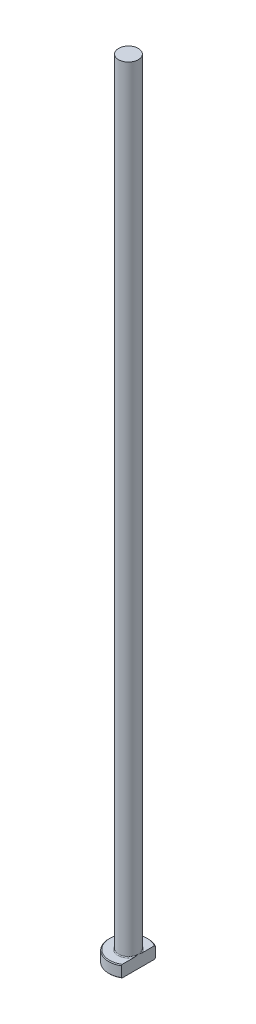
ISO-10303-21;
HEADER;
FILE_DESCRIPTION(('STEP AP214'),'2;1');
FILE_NAME('part.step','',(''),(''),'','','');
FILE_SCHEMA(('AUTOMOTIVE_DESIGN { 1 0 10303 214 1 1 1 1 }'));
ENDSEC;
DATA;
#1=APPLICATION_CONTEXT('core data for automotive mechanical design processes');
#2=APPLICATION_PROTOCOL_DEFINITION('international standard','automotive_design',2000,#1);
#3=PRODUCT_CONTEXT('',#1,'mechanical');
#4=PRODUCT('Part','Part','',(#3));
#5=PRODUCT_RELATED_PRODUCT_CATEGORY('part','',(#4));
#6=PRODUCT_DEFINITION_FORMATION('','',#4);
#7=PRODUCT_DEFINITION_CONTEXT('part definition',#1,'design');
#8=PRODUCT_DEFINITION('design','',#6,#7);
#9=PRODUCT_DEFINITION_SHAPE('','',#8);
#10=(LENGTH_UNIT() NAMED_UNIT(*) SI_UNIT(.MILLI.,.METRE.));
#11=(NAMED_UNIT(*) PLANE_ANGLE_UNIT() SI_UNIT($,.RADIAN.));
#12=(NAMED_UNIT(*) SI_UNIT($,.STERADIAN.) SOLID_ANGLE_UNIT());
#13=UNCERTAINTY_MEASURE_WITH_UNIT(LENGTH_MEASURE(1.E-05),#10,'distance_accuracy_value','');
#14=(GEOMETRIC_REPRESENTATION_CONTEXT(3) GLOBAL_UNCERTAINTY_ASSIGNED_CONTEXT((#13)) GLOBAL_UNIT_ASSIGNED_CONTEXT((#10,
#11,#12)) REPRESENTATION_CONTEXT('',''));
#15=CARTESIAN_POINT('',(0.,0.,0.));
#16=DIRECTION('',(0.,0.,1.));
#17=DIRECTION('',(1.,0.,0.));
#18=AXIS2_PLACEMENT_3D('',#15,#16,#17);
#19=CARTESIAN_POINT('',(0.,0.,0.));
#20=DIRECTION('',(0.,-1.,0.));
#21=DIRECTION('',(0.,0.,-1.));
#22=AXIS2_PLACEMENT_3D('',#19,#20,#21);
#23=PLANE('',#22);
#24=CARTESIAN_POINT('',(0.,0.,0.));
#25=DIRECTION('',(0.,-1.,0.));
#26=DIRECTION('',(0.,0.,-1.));
#27=AXIS2_PLACEMENT_3D('',#24,#25,#26);
#28=CIRCLE('',#27,4.79999999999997);
#29=CARTESIAN_POINT('',(2.49999999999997,0.,4.09756024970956));
#30=VERTEX_POINT('',#29);
#31=CARTESIAN_POINT('',(2.49999999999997,0.,-4.09756024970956));
#32=VERTEX_POINT('',#31);
#33=EDGE_CURVE('E98',#30,#32,#28,.T.);
#34=ORIENTED_EDGE('',*,*,#33,.T.);
#35=DIRECTION('',(0.,0.,1.));
#36=VECTOR('',#35,1.);
#37=CARTESIAN_POINT('',(2.49999999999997,0.,-4.33012701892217));
#38=LINE('',#37,#36);
#39=EDGE_CURVE('E83',#32,#30,#38,.T.);
#40=ORIENTED_EDGE('',*,*,#39,.T.);
#41=EDGE_LOOP('',(#34,#40));
#42=FACE_BOUND('',#41,.T.);
#43=ADVANCED_FACE('F32',(#42),#23,.T.);
#44=CARTESIAN_POINT('',(0.,259.958771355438,0.));
#45=DIRECTION('',(0.,1.,0.));
#46=DIRECTION('',(0.,0.,1.));
#47=AXIS2_PLACEMENT_3D('',#44,#45,#46);
#48=CYLINDRICAL_SURFACE('',#47,4.99999999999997);
#49=CARTESIAN_POINT('',(0.,2.79999999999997,0.));
#50=DIRECTION('',(0.,1.,0.));
#51=DIRECTION('',(0.,0.,1.));
#52=AXIS2_PLACEMENT_3D('',#49,#50,#51);
#53=CIRCLE('',#52,4.99999999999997);
#54=CARTESIAN_POINT('',(2.49999999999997,2.79999999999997,4.33012701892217));
#55=VERTEX_POINT('',#54);
#56=CARTESIAN_POINT('',(2.49999999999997,2.79999999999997,-4.33012701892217));
#57=VERTEX_POINT('',#56);
#58=EDGE_CURVE('E104',#55,#57,#53,.F.);
#59=ORIENTED_EDGE('',*,*,#58,.T.);
#60=DIRECTION('',(0.,-1.,0.));
#61=VECTOR('',#60,1.);
#62=CARTESIAN_POINT('',(2.49999999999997,200.,-4.33012701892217));
#63=LINE('',#62,#61);
#64=CARTESIAN_POINT('',(2.49999999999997,0.200000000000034,-4.33012701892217));
#65=VERTEX_POINT('',#64);
#66=EDGE_CURVE('E183',#57,#65,#63,.T.);
#67=ORIENTED_EDGE('',*,*,#66,.T.);
#68=CARTESIAN_POINT('',(0.,0.200000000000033,0.));
#69=DIRECTION('',(0.,-1.,0.));
#70=DIRECTION('',(0.,0.,-1.));
#71=AXIS2_PLACEMENT_3D('',#68,#69,#70);
#72=CIRCLE('',#71,4.99999999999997);
#73=CARTESIAN_POINT('',(2.49999999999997,0.200000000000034,4.33012701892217));
#74=VERTEX_POINT('',#73);
#75=EDGE_CURVE('E100',#65,#74,#72,.F.);
#76=ORIENTED_EDGE('',*,*,#75,.T.);
#77=DIRECTION('',(0.,-1.,0.));
#78=VECTOR('',#77,1.);
#79=CARTESIAN_POINT('',(2.49999999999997,200.,4.33012701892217));
#80=LINE('',#79,#78);
#81=EDGE_CURVE('E93',#55,#74,#80,.T.);
#82=ORIENTED_EDGE('',*,*,#81,.F.);
#83=EDGE_LOOP('',(#59,#67,#76,#82));
#84=FACE_BOUND('',#83,.T.);
#85=ADVANCED_FACE('F158',(#84),#48,.T.);
#86=CARTESIAN_POINT('',(-4.99999999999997,3.,0.));
#87=DIRECTION('',(0.,1.,0.));
#88=DIRECTION('',(0.,0.,1.));
#89=AXIS2_PLACEMENT_3D('',#86,#87,#88);
#90=PLANE('',#89);
#91=CARTESIAN_POINT('',(0.,3.,0.));
#92=DIRECTION('',(0.,1.,0.));
#93=DIRECTION('',(0.,0.,1.));
#94=AXIS2_PLACEMENT_3D('',#91,#92,#93);
#95=CIRCLE('',#94,4.79999999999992);
#96=CARTESIAN_POINT('',(2.49999999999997,3.,-4.0975602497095));
#97=VERTEX_POINT('',#96);
#98=CARTESIAN_POINT('',(2.49999999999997,3.,4.0975602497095));
#99=VERTEX_POINT('',#98);
#100=EDGE_CURVE('E178',#97,#99,#95,.T.);
#101=ORIENTED_EDGE('',*,*,#100,.T.);
#102=DIRECTION('',(0.,0.,-1.));
#103=VECTOR('',#102,1.);
#104=CARTESIAN_POINT('',(2.49999999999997,3.,0.));
#105=LINE('',#104,#103);
#106=CARTESIAN_POINT('',(2.49999999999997,2.99999999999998,1.01980390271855));
#107=VERTEX_POINT('',#106);
#108=EDGE_CURVE('E57',#99,#107,#105,.T.);
#109=ORIENTED_EDGE('',*,*,#108,.T.);
#110=CARTESIAN_POINT('',(0.,3.,0.));
#111=DIRECTION('',(0.,1.,0.));
#112=DIRECTION('',(0.,0.,1.));
#113=AXIS2_PLACEMENT_3D('',#110,#111,#112);
#114=CIRCLE('',#113,2.69999999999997);
#115=CARTESIAN_POINT('',(2.49999999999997,2.99999999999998,-1.01980390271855));
#116=VERTEX_POINT('',#115);
#117=EDGE_CURVE('E107',#107,#116,#114,.F.);
#118=ORIENTED_EDGE('',*,*,#117,.T.);
#119=EDGE_CURVE('E136',#116,#97,#105,.T.);
#120=ORIENTED_EDGE('',*,*,#119,.T.);
#121=EDGE_LOOP('',(#101,#109,#118,#120));
#122=FACE_BOUND('',#121,.T.);
#123=ADVANCED_FACE('F147',(#122),#90,.T.);
#124=CARTESIAN_POINT('',(0.,3.,0.));
#125=DIRECTION('',(0.,-1.,0.));
#126=DIRECTION('',(0.,0.,-1.));
#127=AXIS2_PLACEMENT_3D('',#124,#125,#126);
#128=CONICAL_SURFACE('',#127,4.79999999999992,0.785398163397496);
#129=ORIENTED_EDGE('',*,*,#58,.F.);
#130=CARTESIAN_POINT('',(2.49999999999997,-2.05039133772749,9.52786489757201));
#131=CARTESIAN_POINT('',(2.49999999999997,-1.8416036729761,9.31199733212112));
#132=CARTESIAN_POINT('',(2.49999999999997,-1.63304008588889,9.09591231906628));
#133=CARTESIAN_POINT('',(2.49999999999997,-1.21649358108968,8.66317810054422));
#134=CARTESIAN_POINT('',(2.49999999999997,-1.0085106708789,8.44652888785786));
#135=CARTESIAN_POINT('',(2.49999999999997,-0.593157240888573,8.01243155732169));
#136=CARTESIAN_POINT('',(2.49999999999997,-0.385787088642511,7.79498308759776));
#137=CARTESIAN_POINT('',(2.49999999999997,0.0280365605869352,7.3592177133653));
#138=CARTESIAN_POINT('',(2.49999999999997,0.234490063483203,7.14090081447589));
#139=CARTESIAN_POINT('',(2.49999999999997,0.642130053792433,6.70748960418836));
#140=CARTESIAN_POINT('',(2.49999999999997,0.8433398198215,6.49241720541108));
#141=CARTESIAN_POINT('',(2.49999999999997,1.2442538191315,6.06087422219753));
#142=CARTESIAN_POINT('',(2.49999999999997,1.44395806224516,5.84440364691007));
#143=CARTESIAN_POINT('',(2.49999999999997,1.84127751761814,5.40963663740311));
#144=CARTESIAN_POINT('',(2.49999999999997,2.03889317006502,5.19134060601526));
#145=CARTESIAN_POINT('',(2.49999999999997,2.43125043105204,4.75218509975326));
#146=CARTESIAN_POINT('',(2.49999999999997,2.62599215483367,4.53132572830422));
#147=CARTESIAN_POINT('',(2.49999999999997,2.93693788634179,4.17181619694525));
#148=CARTESIAN_POINT('',(2.49999999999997,3.05446493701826,4.03431188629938));
#149=CARTESIAN_POINT('',(2.49999999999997,3.28742704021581,3.7575148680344));
#150=CARTESIAN_POINT('',(2.49999999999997,3.40286188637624,3.618221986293));
#151=CARTESIAN_POINT('',(2.49999999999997,3.632132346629,3.3358649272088));
#152=CARTESIAN_POINT('',(2.49999999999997,3.74593818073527,3.1927764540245));
#153=CARTESIAN_POINT('',(2.49999999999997,3.96956266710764,2.90356071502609));
#154=CARTESIAN_POINT('',(2.49999999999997,4.0793822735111,2.75743418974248));
#155=CARTESIAN_POINT('',(2.49999999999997,4.29502410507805,2.45881038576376));
#156=CARTESIAN_POINT('',(2.49999999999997,4.40076032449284,2.30625006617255));
#157=CARTESIAN_POINT('',(2.49999999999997,4.55286945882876,2.07299325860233));
#158=CARTESIAN_POINT('',(2.49999999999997,4.60252613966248,1.9944419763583));
#159=CARTESIAN_POINT('',(2.49999999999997,4.69908164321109,1.83566827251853));
#160=CARTESIAN_POINT('',(2.49999999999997,4.74598077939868,1.75544604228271));
#161=CARTESIAN_POINT('',(2.49999999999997,4.83578466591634,1.59405362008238));
#162=CARTESIAN_POINT('',(2.49999999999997,4.87873126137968,1.5129070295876));
#163=CARTESIAN_POINT('',(2.49999999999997,4.96038600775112,1.34852090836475));
#164=CARTESIAN_POINT('',(2.49999999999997,4.99909338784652,1.26528100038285));
#165=CARTESIAN_POINT('',(2.49999999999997,5.10703093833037,1.01251774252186));
#166=CARTESIAN_POINT('',(2.49999999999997,5.16843307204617,0.839342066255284));
#167=CARTESIAN_POINT('',(2.49999999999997,5.23490554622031,0.579703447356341));
#168=CARTESIAN_POINT('',(2.49999999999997,5.25253806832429,0.496421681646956));
#169=CARTESIAN_POINT('',(2.49999999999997,5.27986337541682,0.328535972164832));
#170=CARTESIAN_POINT('',(2.49999999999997,5.2895568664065,0.243932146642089));
#171=CARTESIAN_POINT('',(2.49999999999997,5.30031768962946,0.0744340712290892));
#172=CARTESIAN_POINT('',(2.49999999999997,5.30141176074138,-0.0104584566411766));
#173=CARTESIAN_POINT('',(2.49999999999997,5.29496530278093,-0.179916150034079));
#174=CARTESIAN_POINT('',(2.49999999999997,5.28742406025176,-0.264481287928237));
#175=CARTESIAN_POINT('',(2.49999999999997,5.26433424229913,-0.431754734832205));
#176=CARTESIAN_POINT('',(2.49999999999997,5.24885436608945,-0.514472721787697));
#177=CARTESIAN_POINT('',(2.49999999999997,5.21085318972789,-0.678257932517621));
#178=CARTESIAN_POINT('',(2.49999999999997,5.18833104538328,-0.759324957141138));
#179=CARTESIAN_POINT('',(2.49999999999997,5.13718929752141,-0.920001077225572));
#180=CARTESIAN_POINT('',(2.49999999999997,5.1085353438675,-0.999599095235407));
#181=CARTESIAN_POINT('',(2.49999999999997,5.04628092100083,-1.15679278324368));
#182=CARTESIAN_POINT('',(2.49999999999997,5.01268146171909,-1.23438885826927));
#183=CARTESIAN_POINT('',(2.49999999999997,4.90558195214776,-1.46503672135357));
#184=CARTESIAN_POINT('',(2.49999999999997,4.82601567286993,-1.61526350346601));
#185=CARTESIAN_POINT('',(2.49999999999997,4.65635232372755,-1.90970759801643));
#186=CARTESIAN_POINT('',(2.49999999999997,4.56624199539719,-2.05391702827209));
#187=CARTESIAN_POINT('',(2.49999999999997,4.37862201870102,-2.33821627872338));
#188=CARTESIAN_POINT('',(2.49999999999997,4.28108460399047,-2.47828761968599));
#189=CARTESIAN_POINT('',(2.49999999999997,4.08116271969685,-2.75478641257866));
#190=CARTESIAN_POINT('',(2.49999999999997,3.97878070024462,-2.8912156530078));
#191=CARTESIAN_POINT('',(2.49999999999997,3.76913910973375,-3.16313520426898));
#192=CARTESIAN_POINT('',(2.49999999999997,3.66183307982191,-3.29858952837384));
#193=CARTESIAN_POINT('',(2.49999999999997,3.44456217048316,-3.56736427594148));
#194=CARTESIAN_POINT('',(2.49999999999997,3.33459700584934,-3.70068446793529));
#195=CARTESIAN_POINT('',(2.49999999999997,3.11293465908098,-3.96532340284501));
#196=CARTESIAN_POINT('',(2.49999999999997,3.00124232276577,-4.09664621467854));
#197=CARTESIAN_POINT('',(2.49999999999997,2.77631276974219,-4.35796341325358));
#198=CARTESIAN_POINT('',(2.49999999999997,2.66307552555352,-4.48795777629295));
#199=CARTESIAN_POINT('',(2.49999999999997,2.36028773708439,-4.83228553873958));
#200=CARTESIAN_POINT('',(2.49999999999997,2.16967435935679,-5.04568363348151));
#201=CARTESIAN_POINT('',(2.49999999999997,1.78611780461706,-5.47037913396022));
#202=CARTESIAN_POINT('',(2.49999999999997,1.59317456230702,-5.68167648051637));
#203=CARTESIAN_POINT('',(2.49999999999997,1.20540648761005,-6.10290357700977));
#204=CARTESIAN_POINT('',(2.49999999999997,1.0105800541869,-6.31283185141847));
#205=CARTESIAN_POINT('',(2.49999999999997,0.619649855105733,-6.73149551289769));
#206=CARTESIAN_POINT('',(2.49999999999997,0.423546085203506,-6.94023089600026));
#207=CARTESIAN_POINT('',(2.49999999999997,0.0384434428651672,-7.34820392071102));
#208=CARTESIAN_POINT('',(2.49999999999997,-0.150515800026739,-7.54747899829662));
#209=CARTESIAN_POINT('',(2.49999999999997,-0.529153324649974,-7.94534601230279));
#210=CARTESIAN_POINT('',(2.49999999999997,-0.718831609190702,-8.14393794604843));
#211=CARTESIAN_POINT('',(2.49999999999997,-1.09855461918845,-8.54034636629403));
#212=CARTESIAN_POINT('',(2.49999999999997,-1.28859869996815,-8.73816347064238));
#213=CARTESIAN_POINT('',(2.49999999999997,-1.66916268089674,-9.13333639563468));
#214=CARTESIAN_POINT('',(2.49999999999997,-1.85968257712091,-9.33069222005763));
#215=CARTESIAN_POINT('',(2.49999999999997,-2.05039133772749,-9.52786489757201));
#216=B_SPLINE_CURVE_WITH_KNOTS('',3,(#130,#131,#132,#133,#134,#135,#136,#137,#138,#139,#140,
#141,#142,#143,#144,#145,#146,#147,#148,#149,#150,#151,#152,#153,#154,#155,#156,#157,#158,#159,
#160,#161,#162,#163,#164,#165,#166,#167,#168,#169,#170,#171,#172,#173,#174,#175,#176,#177,#178,
#179,#180,#181,#182,#183,#184,#185,#186,#187,#188,#189,#190,#191,#192,#193,#194,#195,#196,#197,
#198,#199,#200,#201,#202,#203,#204,#205,#206,#207,#208,#209,#210,#211,#212,#213,#214,#215),
.UNSPECIFIED.,.F.,.F.,(4,2,2,2,2,2,2,2,2,2,2,2,2,2,2,2,2,2,2,2,2,2,2,2,2,2,2,2,2,2,2,2,2,2,2,2,
2,2,2,2,2,2,4),(0.,0.900955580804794,1.8019227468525,2.70335062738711,3.60477268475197,
4.48832484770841,5.37187123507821,6.25522753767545,7.13854832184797,7.68119321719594,
8.22389134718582,8.77232299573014,9.3206224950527,9.87724663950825,10.1559936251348,
10.4347088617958,10.7100145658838,10.9853702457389,11.5339745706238,11.7890461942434,
12.0440951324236,12.2983507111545,12.5526272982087,12.8047396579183,13.0568822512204,
13.310476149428,13.5640183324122,14.0732618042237,14.5831526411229,15.0950533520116,
15.6066978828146,16.1250759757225,16.643509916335,17.1606868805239,17.6778730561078,
18.5362451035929,19.3946412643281,20.2538459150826,21.113053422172,21.9369112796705,
22.7607723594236,23.583714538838,24.4066499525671),.UNSPECIFIED.);
#217=EDGE_CURVE('E135',#55,#99,#216,.T.);
#218=ORIENTED_EDGE('',*,*,#217,.T.);
#219=ORIENTED_EDGE('',*,*,#100,.F.);
#220=EDGE_CURVE('E127',#97,#57,#216,.T.);
#221=ORIENTED_EDGE('',*,*,#220,.T.);
#222=EDGE_LOOP('',(#129,#218,#219,#221));
#223=FACE_BOUND('',#222,.T.);
#224=ADVANCED_FACE('F143',(#223),#128,.T.);
#225=CARTESIAN_POINT('',(0.,0.200000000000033,0.));
#226=DIRECTION('',(0.,1.,0.));
#227=DIRECTION('',(0.,0.,1.));
#228=AXIS2_PLACEMENT_3D('',#225,#226,#227);
#229=CONICAL_SURFACE('',#228,4.99999999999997,0.785398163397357);
#230=ORIENTED_EDGE('',*,*,#75,.F.);
#231=CARTESIAN_POINT('',(2.49999999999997,5.05039133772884,-9.52786489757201));
#232=CARTESIAN_POINT('',(2.49999999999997,4.84160367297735,-9.31199733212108));
#233=CARTESIAN_POINT('',(2.49999999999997,4.63304008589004,-9.0959123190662));
#234=CARTESIAN_POINT('',(2.49999999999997,4.21649358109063,-8.66317810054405));
#235=CARTESIAN_POINT('',(2.49999999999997,4.00851067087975,-8.44652888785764));
#236=CARTESIAN_POINT('',(2.49999999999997,3.59315724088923,-8.01243155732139));
#237=CARTESIAN_POINT('',(2.49999999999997,3.38578708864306,-7.79498308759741));
#238=CARTESIAN_POINT('',(2.49999999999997,2.97196343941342,-7.35921771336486));
#239=CARTESIAN_POINT('',(2.49999999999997,2.76550993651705,-7.1409008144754));
#240=CARTESIAN_POINT('',(2.49999999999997,2.35786994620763,-6.70748960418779));
#241=CARTESIAN_POINT('',(2.49999999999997,2.15666018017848,-6.49241720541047));
#242=CARTESIAN_POINT('',(2.49999999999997,1.7557461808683,-6.06087422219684));
#243=CARTESIAN_POINT('',(2.49999999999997,1.55604193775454,-5.84440364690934));
#244=CARTESIAN_POINT('',(2.49999999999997,1.15872248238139,-5.4096366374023));
#245=CARTESIAN_POINT('',(2.49999999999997,0.961106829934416,-5.1913406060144));
#246=CARTESIAN_POINT('',(2.49999999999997,0.568749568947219,-4.7521850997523));
#247=CARTESIAN_POINT('',(2.49999999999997,0.374007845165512,-4.53132572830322));
#248=CARTESIAN_POINT('',(2.49999999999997,0.0630621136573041,-4.17181619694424));
#249=CARTESIAN_POINT('',(2.49999999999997,-0.0544649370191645,-4.0343118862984));
#250=CARTESIAN_POINT('',(2.49999999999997,-0.287427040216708,-3.75751486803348));
#251=CARTESIAN_POINT('',(2.49999999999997,-0.40286188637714,-3.61822198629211));
#252=CARTESIAN_POINT('',(2.49999999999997,-0.632132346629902,-3.33586492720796));
#253=CARTESIAN_POINT('',(2.49999999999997,-0.745938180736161,-3.19277645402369));
#254=CARTESIAN_POINT('',(2.49999999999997,-0.969562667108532,-2.90356071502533));
#255=CARTESIAN_POINT('',(2.49999999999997,-1.07938227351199,-2.75743418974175));
#256=CARTESIAN_POINT('',(2.49999999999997,-1.29502410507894,-2.45881038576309));
#257=CARTESIAN_POINT('',(2.49999999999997,-1.40076032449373,-2.3062500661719));
#258=CARTESIAN_POINT('',(2.49999999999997,-1.55286945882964,-2.07299325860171));
#259=CARTESIAN_POINT('',(2.49999999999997,-1.60252613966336,-1.99444197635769));
#260=CARTESIAN_POINT('',(2.49999999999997,-1.69908164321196,-1.83566827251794));
#261=CARTESIAN_POINT('',(2.49999999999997,-1.74598077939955,-1.75544604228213));
#262=CARTESIAN_POINT('',(2.49999999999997,-1.8357846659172,-1.59405362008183));
#263=CARTESIAN_POINT('',(2.49999999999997,-1.87873126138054,-1.51290702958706));
#264=CARTESIAN_POINT('',(2.49999999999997,-1.96038600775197,-1.34852090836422));
#265=CARTESIAN_POINT('',(2.49999999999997,-1.99909338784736,-1.26528100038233));
#266=CARTESIAN_POINT('',(2.49999999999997,-2.10703093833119,-1.01251774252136));
#267=CARTESIAN_POINT('',(2.49999999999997,-2.16843307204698,-0.839342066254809));
#268=CARTESIAN_POINT('',(2.49999999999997,-2.23490554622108,-0.579703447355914));
#269=CARTESIAN_POINT('',(2.49999999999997,-2.25253806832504,-0.496421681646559));
#270=CARTESIAN_POINT('',(2.49999999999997,-2.27986337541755,-0.328535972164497));
#271=CARTESIAN_POINT('',(2.49999999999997,-2.28955686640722,-0.243932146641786));
#272=CARTESIAN_POINT('',(2.49999999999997,-2.30031768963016,-0.0744340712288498));
#273=CARTESIAN_POINT('',(2.49999999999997,-2.30141176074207,0.0104584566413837));
#274=CARTESIAN_POINT('',(2.49999999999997,-2.29496530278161,0.179916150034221));
#275=CARTESIAN_POINT('',(2.49999999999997,-2.28742406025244,0.264481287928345));
#276=CARTESIAN_POINT('',(2.49999999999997,-2.2643342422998,0.431754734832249));
#277=CARTESIAN_POINT('',(2.49999999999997,-2.24885436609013,0.514472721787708));
#278=CARTESIAN_POINT('',(2.49999999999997,-2.21085318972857,0.678257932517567));
#279=CARTESIAN_POINT('',(2.49999999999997,-2.18833104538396,0.759324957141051));
#280=CARTESIAN_POINT('',(2.49999999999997,-2.13718929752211,0.920001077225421));
#281=CARTESIAN_POINT('',(2.49999999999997,-2.10853534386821,0.999599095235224));
#282=CARTESIAN_POINT('',(2.49999999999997,-2.04628092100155,1.15679278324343));
#283=CARTESIAN_POINT('',(2.49999999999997,-2.01268146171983,1.23438885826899));
#284=CARTESIAN_POINT('',(2.49999999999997,-1.90558195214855,1.46503672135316));
#285=CARTESIAN_POINT('',(2.49999999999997,-1.82601567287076,1.61526350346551));
#286=CARTESIAN_POINT('',(2.49999999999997,-1.65635232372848,1.90970759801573));
#287=CARTESIAN_POINT('',(2.49999999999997,-1.56624199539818,2.05391702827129));
#288=CARTESIAN_POINT('',(2.49999999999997,-1.37862201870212,2.33821627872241));
#289=CARTESIAN_POINT('',(2.49999999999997,-1.28108460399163,2.47828761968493));
#290=CARTESIAN_POINT('',(2.49999999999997,-1.08116271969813,2.75478641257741));
#291=CARTESIAN_POINT('',(2.49999999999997,-0.978780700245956,2.89121565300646));
#292=CARTESIAN_POINT('',(2.49999999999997,-0.769139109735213,3.16313520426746));
#293=CARTESIAN_POINT('',(2.49999999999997,-0.661833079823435,3.29858952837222));
#294=CARTESIAN_POINT('',(2.49999999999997,-0.444562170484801,3.56736427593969));
#295=CARTESIAN_POINT('',(2.49999999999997,-0.334597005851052,3.70068446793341));
#296=CARTESIAN_POINT('',(2.49999999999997,-0.112934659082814,3.96532340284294));
#297=CARTESIAN_POINT('',(2.49999999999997,-0.00124232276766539,4.09664621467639));
#298=CARTESIAN_POINT('',(2.49999999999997,0.223687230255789,4.35796341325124));
#299=CARTESIAN_POINT('',(2.49999999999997,0.336924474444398,4.48795777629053));
#300=CARTESIAN_POINT('',(2.49999999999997,0.639712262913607,4.83228553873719));
#301=CARTESIAN_POINT('',(2.49999999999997,0.830325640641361,5.04568363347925));
#302=CARTESIAN_POINT('',(2.49999999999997,1.21388219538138,5.4703791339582));
#303=CARTESIAN_POINT('',(2.49999999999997,1.40682543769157,5.68167648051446));
#304=CARTESIAN_POINT('',(2.49999999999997,1.79459351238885,6.1029035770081));
#305=CARTESIAN_POINT('',(2.49999999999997,1.98941994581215,6.31283185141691));
#306=CARTESIAN_POINT('',(2.49999999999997,2.38035014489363,6.73149551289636));
#307=CARTESIAN_POINT('',(2.49999999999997,2.57645391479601,6.94023089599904));
#308=CARTESIAN_POINT('',(2.49999999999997,2.96155655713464,7.34820392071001));
#309=CARTESIAN_POINT('',(2.49999999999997,3.15051580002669,7.5474789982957));
#310=CARTESIAN_POINT('',(2.49999999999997,3.5291533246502,7.94534601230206));
#311=CARTESIAN_POINT('',(2.49999999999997,3.71883160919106,8.14393794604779));
#312=CARTESIAN_POINT('',(2.49999999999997,4.0985546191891,8.54034636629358));
#313=CARTESIAN_POINT('',(2.49999999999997,4.28859869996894,8.73816347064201));
#314=CARTESIAN_POINT('',(2.49999999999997,4.6691626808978,9.13333639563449));
#315=CARTESIAN_POINT('',(2.49999999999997,4.85968257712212,9.33069222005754));
#316=CARTESIAN_POINT('',(2.49999999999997,5.05039133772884,9.52786489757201));
#317=B_SPLINE_CURVE_WITH_KNOTS('',3,(#231,#232,#233,#234,#235,#236,#237,#238,#239,#240,#241,
#242,#243,#244,#245,#246,#247,#248,#249,#250,#251,#252,#253,#254,#255,#256,#257,#258,#259,#260,
#261,#262,#263,#264,#265,#266,#267,#268,#269,#270,#271,#272,#273,#274,#275,#276,#277,#278,#279,
#280,#281,#282,#283,#284,#285,#286,#287,#288,#289,#290,#291,#292,#293,#294,#295,#296,#297,#298,
#299,#300,#301,#302,#303,#304,#305,#306,#307,#308,#309,#310,#311,#312,#313,#314,#315,#316),
.UNSPECIFIED.,.F.,.F.,(4,2,2,2,2,2,2,2,2,2,2,2,2,2,2,2,2,2,2,2,2,2,2,2,2,2,2,2,2,2,2,2,2,2,2,2,
2,2,2,2,2,2,4),(0.,0.900955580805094,1.8019227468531,2.70335062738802,3.60477268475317,
4.48832484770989,5.37187123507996,6.25522753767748,7.13854832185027,7.68119321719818,
8.22389134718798,8.77232299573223,9.32062249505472,9.87724663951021,10.1559936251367,
10.4347088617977,10.7100145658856,10.9853702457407,11.5339745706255,11.789046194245,
12.0440951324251,12.298350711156,12.5526272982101,12.8047396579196,13.0568822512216,
13.3104761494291,13.5640183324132,14.0732618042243,14.5831526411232,15.0950533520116,
15.6066978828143,16.1250759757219,16.6435099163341,17.1606868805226,17.6778730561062,
18.5362451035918,19.3946412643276,20.2538459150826,21.1130534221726,21.9369112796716,
22.7607723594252,23.5837145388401,24.4066499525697),.UNSPECIFIED.);
#318=EDGE_CURVE('E86',#65,#32,#317,.T.);
#319=ORIENTED_EDGE('',*,*,#318,.T.);
#320=ORIENTED_EDGE('',*,*,#33,.F.);
#321=EDGE_CURVE('E89',#30,#74,#317,.T.);
#322=ORIENTED_EDGE('',*,*,#321,.T.);
#323=EDGE_LOOP('',(#230,#319,#320,#322));
#324=FACE_BOUND('',#323,.T.);
#325=ADVANCED_FACE('F97',(#324),#229,.T.);
#326=CARTESIAN_POINT('',(0.,3.19999999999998,0.));
#327=DIRECTION('',(0.,1.,0.));
#328=DIRECTION('',(0.,0.,1.));
#329=AXIS2_PLACEMENT_3D('',#326,#327,#328);
#330=TOROIDAL_SURFACE('',#329,2.69999999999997,0.2);
#331=CARTESIAN_POINT('',(2.49999999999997,3.19999999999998,0.));
#332=CARTESIAN_POINT('',(2.49999999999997,3.20000050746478,5.29061312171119E-11));
#333=CARTESIAN_POINT('',(2.49999999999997,3.20000101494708,-1.70517157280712E-07));
#334=CARTESIAN_POINT('',(2.49999999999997,3.20000196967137,-6.59443804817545E-07));
#335=CARTESIAN_POINT('',(2.49999999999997,3.20000240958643,-9.87883924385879E-07));
#336=CARTESIAN_POINT('',(2.49999999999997,3.20000331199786,-1.7724689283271E-06));
#337=CARTESIAN_POINT('',(2.49999999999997,3.20000376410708,-2.24097229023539E-06));
#338=CARTESIAN_POINT('',(2.49999999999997,3.20000458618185,-3.2218605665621E-06));
#339=CARTESIAN_POINT('',(2.49999999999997,3.20000495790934,-3.73286586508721E-06));
#340=CARTESIAN_POINT('',(2.49999999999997,3.20000630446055,-5.67453781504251E-06));
#341=CARTESIAN_POINT('',(2.49999999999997,3.20000720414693,-7.15943624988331E-06));
#342=CARTESIAN_POINT('',(2.49999999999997,3.20000871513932,-1.01304383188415E-05));
#343=CARTESIAN_POINT('',(2.49999999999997,3.20000934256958,-1.16087237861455E-05));
#344=CARTESIAN_POINT('',(2.49999999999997,3.20001191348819,-1.77555555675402E-05));
#345=CARTESIAN_POINT('',(2.49999999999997,3.20001378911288,-2.24564506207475E-05));
#346=CARTESIAN_POINT('',(2.49999999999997,3.20001661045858,-3.14167101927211E-05));
#347=CARTESIAN_POINT('',(2.49999999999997,3.20001764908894,-3.56468503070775E-05));
#348=CARTESIAN_POINT('',(2.49999999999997,3.20002511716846,-6.67543462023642E-05));
#349=CARTESIAN_POINT('',(2.49999999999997,3.20003067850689,-9.37930225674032E-05));
#350=CARTESIAN_POINT('',(2.49999999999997,3.20005501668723,-0.000200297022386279));
#351=CARTESIAN_POINT('',(2.49999999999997,3.20007833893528,-0.000278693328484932));
#352=CARTESIAN_POINT('',(2.49999999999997,3.20016883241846,-0.000588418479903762));
#353=CARTESIAN_POINT('',(2.49999999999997,3.2002329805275,-0.000820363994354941));
#354=CARTESIAN_POINT('',(2.49999999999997,3.20048923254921,-0.00173961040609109));
#355=CARTESIAN_POINT('',(2.49999999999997,3.20068508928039,-0.00242612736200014));
#356=CARTESIAN_POINT('',(2.49999999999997,3.201497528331,-0.00528196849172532));
#357=CARTESIAN_POINT('',(2.49999999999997,3.20210941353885,-0.0074522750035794));
#358=CARTESIAN_POINT('',(2.49999999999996,3.20774599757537,-0.0274346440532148));
#359=CARTESIAN_POINT('',(2.49999999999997,3.21279017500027,-0.0452427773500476));
#360=CARTESIAN_POINT('',(2.49999999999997,3.22264347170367,-0.080167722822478));
#361=CARTESIAN_POINT('',(2.49999999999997,3.22745402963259,-0.0972841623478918));
#362=CARTESIAN_POINT('',(2.49999999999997,3.23763483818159,-0.133672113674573));
#363=CARTESIAN_POINT('',(2.49999999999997,3.24299975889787,-0.15294514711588));
#364=CARTESIAN_POINT('',(2.49999999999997,3.25370389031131,-0.191722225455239));
#365=CARTESIAN_POINT('',(2.49999999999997,3.25904219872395,-0.211226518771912));
#366=CARTESIAN_POINT('',(2.49999999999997,3.27184445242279,-0.258540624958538));
#367=CARTESIAN_POINT('',(2.49999999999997,3.27925018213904,-0.286366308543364));
#368=CARTESIAN_POINT('',(2.49999999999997,3.29355148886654,-0.341371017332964));
#369=CARTESIAN_POINT('',(2.49999999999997,3.30045534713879,-0.368547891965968));
#370=CARTESIAN_POINT('',(2.49999999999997,3.31991129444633,-0.447507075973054));
#371=CARTESIAN_POINT('',(2.49999999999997,3.33195369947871,-0.499417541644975));
#372=CARTESIAN_POINT('',(2.49999999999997,3.35404241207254,-0.60418810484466));
#373=CARTESIAN_POINT('',(2.49999999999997,3.36406867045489,-0.657052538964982));
#374=CARTESIAN_POINT('',(2.49999999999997,3.38176575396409,-0.767598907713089));
#375=CARTESIAN_POINT('',(2.49999999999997,3.38917909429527,-0.825323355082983));
#376=CARTESIAN_POINT('',(2.49999999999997,3.39884096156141,-0.94105511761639));
#377=CARTESIAN_POINT('',(2.49999999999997,3.40111055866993,-0.999060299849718));
#378=CARTESIAN_POINT('',(2.49999999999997,3.39847691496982,-1.09324578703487));
#379=CARTESIAN_POINT('',(2.49999999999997,3.39593644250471,-1.12948454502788));
#380=CARTESIAN_POINT('',(2.49999999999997,3.38674319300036,-1.20096926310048));
#381=CARTESIAN_POINT('',(2.49999999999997,3.38015410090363,-1.2362219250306));
#382=CARTESIAN_POINT('',(2.49999999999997,3.36639936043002,-1.28579148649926));
#383=CARTESIAN_POINT('',(2.49999999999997,3.36162670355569,-1.30076836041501));
#384=CARTESIAN_POINT('',(2.49999999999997,3.35062798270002,-1.33028325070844));
#385=CARTESIAN_POINT('',(2.49999999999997,3.34439458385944,-1.34481861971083));
#386=CARTESIAN_POINT('',(2.49999999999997,3.33003808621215,-1.37319413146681));
#387=CARTESIAN_POINT('',(2.49999999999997,3.32189015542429,-1.38702194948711));
#388=CARTESIAN_POINT('',(2.49999999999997,3.30325367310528,-1.4129811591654));
#389=CARTESIAN_POINT('',(2.49999999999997,3.2927824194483,-1.42512406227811));
#390=CARTESIAN_POINT('',(2.49999999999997,3.27569207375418,-1.44029611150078));
#391=CARTESIAN_POINT('',(2.49999999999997,3.27021837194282,-1.4446101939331));
#392=CARTESIAN_POINT('',(2.49999999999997,3.25870897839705,-1.45242709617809));
#393=CARTESIAN_POINT('',(2.49999999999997,3.25267333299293,-1.45592998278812));
#394=CARTESIAN_POINT('',(2.49999999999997,3.24001938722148,-1.46191450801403));
#395=CARTESIAN_POINT('',(2.49999999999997,3.233395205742,-1.46438399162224));
#396=CARTESIAN_POINT('',(2.49999999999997,3.21979347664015,-1.46798853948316));
#397=CARTESIAN_POINT('',(2.49999999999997,3.21281651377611,-1.46912574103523));
#398=CARTESIAN_POINT('',(2.49999999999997,3.19961348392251,-1.46988240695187));
#399=CARTESIAN_POINT('',(2.49999999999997,3.19339654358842,-1.46966594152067));
#400=CARTESIAN_POINT('',(2.49999999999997,3.18110362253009,-1.46811597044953));
#401=CARTESIAN_POINT('',(2.49999999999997,3.17502769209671,-1.46678207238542));
#402=CARTESIAN_POINT('',(2.49999999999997,3.16354702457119,-1.46323301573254));
#403=CARTESIAN_POINT('',(2.49999999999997,3.15812390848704,-1.46107586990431));
#404=CARTESIAN_POINT('',(2.49999999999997,3.14763458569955,-1.45603007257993));
#405=CARTESIAN_POINT('',(2.49999999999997,3.14256845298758,-1.45314127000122));
#406=CARTESIAN_POINT('',(2.49999999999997,3.12963191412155,-1.44468844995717));
#407=CARTESIAN_POINT('',(2.49999999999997,3.12209714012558,-1.43861122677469));
#408=CARTESIAN_POINT('',(2.49999999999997,3.10805350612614,-1.42536327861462));
#409=CARTESIAN_POINT('',(2.49999999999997,3.10154826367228,-1.418188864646));
#410=CARTESIAN_POINT('',(2.49999999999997,3.08513615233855,-1.39772885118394));
#411=CARTESIAN_POINT('',(2.49999999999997,3.07611692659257,-1.38373739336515));
#412=CARTESIAN_POINT('',(2.49999999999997,3.06018433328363,-1.35465370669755));
#413=CARTESIAN_POINT('',(2.49999999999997,3.0532724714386,-1.33956070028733));
#414=CARTESIAN_POINT('',(2.49999999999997,3.04107204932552,-1.30868385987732));
#415=CARTESIAN_POINT('',(2.49999999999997,3.03578911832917,-1.29289784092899));
#416=CARTESIAN_POINT('',(2.49999999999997,3.02655583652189,-1.26093375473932));
#417=CARTESIAN_POINT('',(2.49999999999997,3.0226069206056,-1.24475528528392));
#418=CARTESIAN_POINT('',(2.49999999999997,3.01232854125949,-1.19551094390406));
#419=CARTESIAN_POINT('',(2.49999999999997,3.00769429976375,-1.16209442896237));
#420=CARTESIAN_POINT('',(2.49999999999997,3.00005311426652,-1.07761506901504));
#421=CARTESIAN_POINT('',(2.49999999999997,2.99913690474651,-1.02638928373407));
#422=CARTESIAN_POINT('',(2.49999999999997,3.00223345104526,-0.923947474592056));
#423=CARTESIAN_POINT('',(2.49999999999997,3.00626667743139,-0.872732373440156));
#424=CARTESIAN_POINT('',(2.49999999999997,3.01749958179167,-0.773934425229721));
#425=CARTESIAN_POINT('',(2.49999999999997,3.02448410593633,-0.72632575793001));
#426=CARTESIAN_POINT('',(2.49999999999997,3.04066526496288,-0.631906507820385));
#427=CARTESIAN_POINT('',(2.49999999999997,3.0498429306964,-0.585092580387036));
#428=CARTESIAN_POINT('',(2.49999999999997,3.06791405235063,-0.500780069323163));
#429=CARTESIAN_POINT('',(2.49999999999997,3.07652349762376,-0.463219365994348));
#430=CARTESIAN_POINT('',(2.49999999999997,3.09478102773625,-0.387318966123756));
#431=CARTESIAN_POINT('',(2.49999999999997,3.10445029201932,-0.348984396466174));
#432=CARTESIAN_POINT('',(2.49999999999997,3.12135487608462,-0.284095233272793));
#433=CARTESIAN_POINT('',(2.49999999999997,3.12843710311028,-0.257500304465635));
#434=CARTESIAN_POINT('',(2.49999999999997,3.14273562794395,-0.204655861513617));
#435=CARTESIAN_POINT('',(2.49999999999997,3.1499496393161,-0.178405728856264));
#436=CARTESIAN_POINT('',(2.49999999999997,3.1636921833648,-0.128877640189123));
#437=CARTESIAN_POINT('',(2.49999999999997,3.17020707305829,-0.10559584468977));
#438=CARTESIAN_POINT('',(2.49999999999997,3.18358099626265,-0.0580847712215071));
#439=CARTESIAN_POINT('',(2.49999999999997,3.19044308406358,-0.033856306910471));
#440=CARTESIAN_POINT('',(2.49999999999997,3.19789108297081,-0.00745034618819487));
#441=CARTESIAN_POINT('',(2.49999999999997,3.198503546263,-0.00527812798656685));
#442=CARTESIAN_POINT('',(2.49999999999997,3.1993161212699,-0.0024218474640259));
#443=CARTESIAN_POINT('',(2.49999999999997,3.19951155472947,-0.00173680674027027));
#444=CARTESIAN_POINT('',(2.49999999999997,3.19976729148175,-0.000819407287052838));
#445=CARTESIAN_POINT('',(2.49999999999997,3.19983133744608,-0.00058783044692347));
#446=CARTESIAN_POINT('',(2.49999999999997,3.19992170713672,-0.000278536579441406));
#447=CARTESIAN_POINT('',(2.49999999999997,3.19994501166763,-0.000200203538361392));
#448=CARTESIAN_POINT('',(2.49999999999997,3.19996933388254,-9.3772760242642E-05));
#449=CARTESIAN_POINT('',(2.49999999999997,3.19997489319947,-6.67431741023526E-05));
#450=CARTESIAN_POINT('',(2.49999999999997,3.1999823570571,-3.56449049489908E-05));
#451=CARTESIAN_POINT('',(2.49999999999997,3.19998339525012,-3.14152905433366E-05));
#452=CARTESIAN_POINT('',(2.49999999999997,3.19998621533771,-2.24560901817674E-05));
#453=CARTESIAN_POINT('',(2.49999999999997,3.19998809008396,-1.77557009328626E-05));
#454=CARTESIAN_POINT('',(2.49999999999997,3.19999065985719,-1.16093871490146E-05));
#455=CARTESIAN_POINT('',(2.49999999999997,3.1999912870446,-1.01311410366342E-05));
#456=CARTESIAN_POINT('',(2.49999999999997,3.19999279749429,-7.16017592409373E-06));
#457=CARTESIAN_POINT('',(2.49999999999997,3.19999369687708,-5.67527054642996E-06));
#458=CARTESIAN_POINT('',(2.49999999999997,3.19999504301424,-3.73354014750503E-06));
#459=CARTESIAN_POINT('',(2.49999999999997,3.19999541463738,-3.22250653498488E-06));
#460=CARTESIAN_POINT('',(2.49999999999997,3.19999623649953,-2.24154280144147E-06));
#461=CARTESIAN_POINT('',(2.49999999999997,3.19999668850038,-1.77299174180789E-06));
#462=CARTESIAN_POINT('',(2.49999999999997,3.19999759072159,-9.88293774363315E-07));
#463=CARTESIAN_POINT('',(2.49999999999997,3.19999803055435,-6.59792278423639E-07));
#464=CARTESIAN_POINT('',(2.49999999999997,3.19999898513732,-1.7071215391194E-07));
#465=CARTESIAN_POINT('',(2.49999999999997,3.1999994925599,-5.29035539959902E-11));
#466=CARTESIAN_POINT('',(2.49999999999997,3.19999999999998,0.));
#467=B_SPLINE_CURVE_WITH_KNOTS('',3,(#331,#332,#333,#334,#335,#336,#337,#338,#339,#340,#341,
#342,#343,#344,#345,#346,#347,#348,#349,#350,#351,#352,#353,#354,#355,#356,#357,#358,#359,#360,
#361,#362,#363,#364,#365,#366,#367,#368,#369,#370,#371,#372,#373,#374,#375,#376,#377,#378,#379,
#380,#381,#382,#383,#384,#385,#386,#387,#388,#389,#390,#391,#392,#393,#394,#395,#396,#397,#398,
#399,#400,#401,#402,#403,#404,#405,#406,#407,#408,#409,#410,#411,#412,#413,#414,#415,#416,#417,
#418,#419,#420,#421,#422,#423,#424,#425,#426,#427,#428,#429,#430,#431,#432,#433,#434,#435,#436,
#437,#438,#439,#440,#441,#442,#443,#444,#445,#446,#447,#448,#449,#450,#451,#452,#453,#454,#455,
#456,#457,#458,#459,#460,#461,#462,#463,#464,#465,#466),.UNSPECIFIED.,.T.,.F.,(4,2,2,2,2,2,2,2,
2,2,2,2,2,2,2,2,2,2,2,2,2,2,2,2,2,2,2,2,2,2,2,2,2,2,2,2,2,2,2,2,2,2,2,2,2,2,2,2,2,2,2,2,2,2,2,2,
2,2,2,2,2,2,2,2,2,2,2,4),(0.,1.53002989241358E-06,3.17429895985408E-06,5.11692917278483E-06,
7.01128942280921E-06,1.21993179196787E-05,1.70129966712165E-05,3.21659460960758E-05,
4.52166487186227E-05,0.000128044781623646,0.000373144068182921,0.00109538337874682,
0.00323676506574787,0.0100018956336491,0.0655261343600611,0.118865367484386,0.178882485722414,
0.239547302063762,0.325928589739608,0.410047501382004,0.56988542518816,0.731241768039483,
0.905704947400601,1.07945217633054,1.18829443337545,1.2954669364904,1.34257193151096,
1.38991872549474,1.43791728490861,1.4855698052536,1.50642342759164,1.52727533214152,
1.54836603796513,1.56942286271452,1.58798129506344,1.60654624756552,1.62399133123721,
1.64144002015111,1.67031274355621,1.69928476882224,1.74894310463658,1.79863683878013,
1.84850042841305,1.8984174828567,1.99938099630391,2.1527113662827,2.30667804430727,
2.45095908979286,2.59403470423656,2.70962861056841,2.8282269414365,2.91079145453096,
2.99246070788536,3.06498967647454,3.14053132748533,3.14730244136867,3.14943921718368,
3.15016030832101,3.15040521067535,3.15048801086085,3.15050105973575,3.1505162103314,
3.15052102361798,3.15052621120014,3.1505281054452,3.15053004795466,3.15053169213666,
3.15053322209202),.UNSPECIFIED.);
#468=CARTESIAN_POINT('',(2.49999999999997,3.19999999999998,0.));
#469=VERTEX_POINT('',#468);
#470=EDGE_CURVE('E11',#116,#469,#467,.T.);
#471=ORIENTED_EDGE('',*,*,#470,.F.);
#472=ORIENTED_EDGE('',*,*,#117,.F.);
#473=CARTESIAN_POINT('',(2.49999999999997,3.19999999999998,0.));
#474=CARTESIAN_POINT('',(2.49999999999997,3.19999949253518,-5.29060891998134E-11));
#475=CARTESIAN_POINT('',(2.49999999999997,3.19999898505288,1.70517157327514E-07));
#476=CARTESIAN_POINT('',(2.49999999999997,3.19999803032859,6.59443804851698E-07));
#477=CARTESIAN_POINT('',(2.49999999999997,3.19999759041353,9.87883924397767E-07));
#478=CARTESIAN_POINT('',(2.49999999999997,3.19999668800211,1.77246892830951E-06));
#479=CARTESIAN_POINT('',(2.49999999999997,3.19999623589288,2.24097229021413E-06));
#480=CARTESIAN_POINT('',(2.49999999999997,3.19999541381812,3.22186056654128E-06));
#481=CARTESIAN_POINT('',(2.49999999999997,3.19999504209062,3.73286586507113E-06));
#482=CARTESIAN_POINT('',(2.49999999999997,3.19999369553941,5.67453781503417E-06));
#483=CARTESIAN_POINT('',(2.49999999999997,3.19999279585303,7.15943624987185E-06));
#484=CARTESIAN_POINT('',(2.49999999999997,3.19999128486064,1.01304383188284E-05));
#485=CARTESIAN_POINT('',(2.49999999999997,3.19999065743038,1.1608723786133E-05));
#486=CARTESIAN_POINT('',(2.49999999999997,3.19998808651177,1.77555555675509E-05));
#487=CARTESIAN_POINT('',(2.49999999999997,3.19998621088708,2.24564506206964E-05));
#488=CARTESIAN_POINT('',(2.49999999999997,3.19998338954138,3.14167101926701E-05));
#489=CARTESIAN_POINT('',(2.49999999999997,3.19998235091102,3.56468503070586E-05));
#490=CARTESIAN_POINT('',(2.49999999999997,3.19997488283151,6.67543462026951E-05));
#491=CARTESIAN_POINT('',(2.49999999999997,3.19996932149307,9.37930225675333E-05));
#492=CARTESIAN_POINT('',(2.49999999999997,3.19994498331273,0.000200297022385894));
#493=CARTESIAN_POINT('',(2.49999999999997,3.19992166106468,0.000278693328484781));
#494=CARTESIAN_POINT('',(2.49999999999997,3.1998311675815,0.000588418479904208));
#495=CARTESIAN_POINT('',(2.49999999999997,3.19976701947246,0.000820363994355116));
#496=CARTESIAN_POINT('',(2.49999999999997,3.19951076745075,0.00173961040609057));
#497=CARTESIAN_POINT('',(2.49999999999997,3.19931491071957,0.00242612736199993));
#498=CARTESIAN_POINT('',(2.49999999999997,3.19850247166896,0.00528196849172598));
#499=CARTESIAN_POINT('',(2.49999999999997,3.19789058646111,0.00745227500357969));
#500=CARTESIAN_POINT('',(2.49999999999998,3.19225400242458,0.0274346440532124));
#501=CARTESIAN_POINT('',(2.49999999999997,3.18720982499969,0.045242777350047));
#502=CARTESIAN_POINT('',(2.49999999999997,3.17735652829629,0.0801677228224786));
#503=CARTESIAN_POINT('',(2.49999999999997,3.17254597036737,0.0972841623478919));
#504=CARTESIAN_POINT('',(2.49999999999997,3.16236516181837,0.133672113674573));
#505=CARTESIAN_POINT('',(2.49999999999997,3.15700024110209,0.15294514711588));
#506=CARTESIAN_POINT('',(2.49999999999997,3.14629610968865,0.191722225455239));
#507=CARTESIAN_POINT('',(2.49999999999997,3.14095780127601,0.211226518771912));
#508=CARTESIAN_POINT('',(2.49999999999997,3.12815554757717,0.258540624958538));
#509=CARTESIAN_POINT('',(2.49999999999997,3.12074981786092,0.286366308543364));
#510=CARTESIAN_POINT('',(2.49999999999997,3.10644851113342,0.341371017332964));
#511=CARTESIAN_POINT('',(2.49999999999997,3.09954465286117,0.368547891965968));
#512=CARTESIAN_POINT('',(2.49999999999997,3.08008870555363,0.447507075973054));
#513=CARTESIAN_POINT('',(2.49999999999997,3.06804630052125,0.499417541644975));
#514=CARTESIAN_POINT('',(2.49999999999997,3.04595758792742,0.60418810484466));
#515=CARTESIAN_POINT('',(2.49999999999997,3.03593132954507,0.657052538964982));
#516=CARTESIAN_POINT('',(2.49999999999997,3.01823424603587,0.767598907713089));
#517=CARTESIAN_POINT('',(2.49999999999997,3.01082090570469,0.825323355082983));
#518=CARTESIAN_POINT('',(2.49999999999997,3.00115903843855,0.94105511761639));
#519=CARTESIAN_POINT('',(2.49999999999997,2.99888944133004,0.999060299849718));
#520=CARTESIAN_POINT('',(2.49999999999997,3.00152308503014,1.09324578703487));
#521=CARTESIAN_POINT('',(2.49999999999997,3.00406355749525,1.12948454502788));
#522=CARTESIAN_POINT('',(2.49999999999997,3.0132568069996,1.20096926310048));
#523=CARTESIAN_POINT('',(2.49999999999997,3.01984589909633,1.2362219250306));
#524=CARTESIAN_POINT('',(2.49999999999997,3.03360063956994,1.28579148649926));
#525=CARTESIAN_POINT('',(2.49999999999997,3.03837329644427,1.30076836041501));
#526=CARTESIAN_POINT('',(2.49999999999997,3.04937201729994,1.33028325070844));
#527=CARTESIAN_POINT('',(2.49999999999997,3.05560541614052,1.34481861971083));
#528=CARTESIAN_POINT('',(2.49999999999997,3.06996191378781,1.37319413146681));
#529=CARTESIAN_POINT('',(2.49999999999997,3.07810984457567,1.38702194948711));
#530=CARTESIAN_POINT('',(2.49999999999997,3.09674632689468,1.4129811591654));
#531=CARTESIAN_POINT('',(2.49999999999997,3.10721758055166,1.42512406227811));
#532=CARTESIAN_POINT('',(2.49999999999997,3.12430792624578,1.44029611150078));
#533=CARTESIAN_POINT('',(2.49999999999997,3.12978162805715,1.4446101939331));
#534=CARTESIAN_POINT('',(2.49999999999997,3.14129102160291,1.45242709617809));
#535=CARTESIAN_POINT('',(2.49999999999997,3.14732666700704,1.45592998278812));
#536=CARTESIAN_POINT('',(2.49999999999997,3.15998061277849,1.46191450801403));
#537=CARTESIAN_POINT('',(2.49999999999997,3.16660479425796,1.46438399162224));
#538=CARTESIAN_POINT('',(2.49999999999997,3.18020652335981,1.46798853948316));
#539=CARTESIAN_POINT('',(2.49999999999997,3.18718348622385,1.46912574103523));
#540=CARTESIAN_POINT('',(2.49999999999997,3.20038651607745,1.46988240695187));
#541=CARTESIAN_POINT('',(2.49999999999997,3.20660345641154,1.46966594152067));
#542=CARTESIAN_POINT('',(2.49999999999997,3.21889637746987,1.46811597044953));
#543=CARTESIAN_POINT('',(2.49999999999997,3.22497230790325,1.46678207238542));
#544=CARTESIAN_POINT('',(2.49999999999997,3.23645297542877,1.46323301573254));
#545=CARTESIAN_POINT('',(2.49999999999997,3.24187609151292,1.46107586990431));
#546=CARTESIAN_POINT('',(2.49999999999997,3.25236541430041,1.45603007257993));
#547=CARTESIAN_POINT('',(2.49999999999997,3.25743154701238,1.45314127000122));
#548=CARTESIAN_POINT('',(2.49999999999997,3.27036808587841,1.44468844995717));
#549=CARTESIAN_POINT('',(2.49999999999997,3.27790285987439,1.43861122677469));
#550=CARTESIAN_POINT('',(2.49999999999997,3.29194649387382,1.42536327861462));
#551=CARTESIAN_POINT('',(2.49999999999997,3.29845173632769,1.418188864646));
#552=CARTESIAN_POINT('',(2.49999999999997,3.31486384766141,1.39772885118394));
#553=CARTESIAN_POINT('',(2.49999999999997,3.3238830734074,1.38373739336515));
#554=CARTESIAN_POINT('',(2.49999999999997,3.33981566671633,1.35465370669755));
#555=CARTESIAN_POINT('',(2.49999999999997,3.34672752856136,1.33956070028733));
#556=CARTESIAN_POINT('',(2.49999999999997,3.35892795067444,1.30868385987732));
#557=CARTESIAN_POINT('',(2.49999999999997,3.36421088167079,1.29289784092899));
#558=CARTESIAN_POINT('',(2.49999999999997,3.37344416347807,1.26093375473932));
#559=CARTESIAN_POINT('',(2.49999999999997,3.37739307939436,1.24475528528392));
#560=CARTESIAN_POINT('',(2.49999999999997,3.38767145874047,1.19551094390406));
#561=CARTESIAN_POINT('',(2.49999999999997,3.39230570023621,1.16209442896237));
#562=CARTESIAN_POINT('',(2.49999999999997,3.39994688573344,1.07761506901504));
#563=CARTESIAN_POINT('',(2.49999999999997,3.40086309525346,1.02638928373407));
#564=CARTESIAN_POINT('',(2.49999999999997,3.3977665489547,0.923947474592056));
#565=CARTESIAN_POINT('',(2.49999999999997,3.39373332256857,0.872732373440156));
#566=CARTESIAN_POINT('',(2.49999999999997,3.38250041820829,0.773934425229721));
#567=CARTESIAN_POINT('',(2.49999999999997,3.37551589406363,0.72632575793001));
#568=CARTESIAN_POINT('',(2.49999999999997,3.35933473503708,0.631906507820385));
#569=CARTESIAN_POINT('',(2.49999999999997,3.35015706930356,0.585092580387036));
#570=CARTESIAN_POINT('',(2.49999999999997,3.33208594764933,0.500780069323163));
#571=CARTESIAN_POINT('',(2.49999999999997,3.3234765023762,0.463219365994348));
#572=CARTESIAN_POINT('',(2.49999999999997,3.30521897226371,0.387318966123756));
#573=CARTESIAN_POINT('',(2.49999999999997,3.29554970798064,0.348984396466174));
#574=CARTESIAN_POINT('',(2.49999999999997,3.27864512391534,0.284095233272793));
#575=CARTESIAN_POINT('',(2.49999999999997,3.27156289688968,0.257500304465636));
#576=CARTESIAN_POINT('',(2.49999999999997,3.25726437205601,0.204655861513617));
#577=CARTESIAN_POINT('',(2.49999999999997,3.25005036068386,0.178405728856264));
#578=CARTESIAN_POINT('',(2.49999999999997,3.23630781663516,0.128877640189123));
#579=CARTESIAN_POINT('',(2.49999999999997,3.22979292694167,0.10559584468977));
#580=CARTESIAN_POINT('',(2.49999999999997,3.21641900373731,0.0580847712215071));
#581=CARTESIAN_POINT('',(2.49999999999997,3.20955691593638,0.0338563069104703));
#582=CARTESIAN_POINT('',(2.49999999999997,3.20210891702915,0.00745034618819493));
#583=CARTESIAN_POINT('',(2.49999999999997,3.20149645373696,0.00527812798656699));
#584=CARTESIAN_POINT('',(2.49999999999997,3.20068387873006,0.00242184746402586));
#585=CARTESIAN_POINT('',(2.49999999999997,3.20048844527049,0.00173680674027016));
#586=CARTESIAN_POINT('',(2.49999999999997,3.20023270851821,0.000819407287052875));
#587=CARTESIAN_POINT('',(2.49999999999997,3.20016866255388,0.000587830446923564));
#588=CARTESIAN_POINT('',(2.49999999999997,3.20007829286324,0.000278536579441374));
#589=CARTESIAN_POINT('',(2.49999999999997,3.20005498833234,0.000200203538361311));
#590=CARTESIAN_POINT('',(2.49999999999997,3.20003066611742,9.37727602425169E-05));
#591=CARTESIAN_POINT('',(2.49999999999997,3.20002510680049,6.6743174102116E-05));
#592=CARTESIAN_POINT('',(2.49999999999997,3.20001764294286,3.56449049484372E-05));
#593=CARTESIAN_POINT('',(2.49999999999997,3.20001660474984,3.14152905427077E-05));
#594=CARTESIAN_POINT('',(2.49999999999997,3.20001378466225,2.24560901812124E-05));
#595=CARTESIAN_POINT('',(2.49999999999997,3.200011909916,1.77557009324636E-05));
#596=CARTESIAN_POINT('',(2.49999999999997,3.20000934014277,1.16093871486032E-05));
#597=CARTESIAN_POINT('',(2.49999999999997,3.20000871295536,1.01311410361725E-05));
#598=CARTESIAN_POINT('',(2.49999999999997,3.20000720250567,7.16017592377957E-06));
#599=CARTESIAN_POINT('',(2.49999999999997,3.20000630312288,5.67527054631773E-06));
#600=CARTESIAN_POINT('',(2.49999999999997,3.20000495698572,3.73354014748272E-06));
#601=CARTESIAN_POINT('',(2.49999999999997,3.20000458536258,3.22250653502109E-06));
#602=CARTESIAN_POINT('',(2.49999999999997,3.20000376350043,2.24154280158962E-06));
#603=CARTESIAN_POINT('',(2.49999999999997,3.20000331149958,1.77299174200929E-06));
#604=CARTESIAN_POINT('',(2.49999999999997,3.20000240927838,9.88293774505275E-07));
#605=CARTESIAN_POINT('',(2.49999999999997,3.20000196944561,6.59792278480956E-07));
#606=CARTESIAN_POINT('',(2.49999999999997,3.20000101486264,1.7071215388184E-07));
#607=CARTESIAN_POINT('',(2.49999999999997,3.20000050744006,5.29035119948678E-11));
#608=CARTESIAN_POINT('',(2.49999999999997,3.19999999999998,0.));
#609=B_SPLINE_CURVE_WITH_KNOTS('',3,(#473,#474,#475,#476,#477,#478,#479,#480,#481,#482,#483,
#484,#485,#486,#487,#488,#489,#490,#491,#492,#493,#494,#495,#496,#497,#498,#499,#500,#501,#502,
#503,#504,#505,#506,#507,#508,#509,#510,#511,#512,#513,#514,#515,#516,#517,#518,#519,#520,#521,
#522,#523,#524,#525,#526,#527,#528,#529,#530,#531,#532,#533,#534,#535,#536,#537,#538,#539,#540,
#541,#542,#543,#544,#545,#546,#547,#548,#549,#550,#551,#552,#553,#554,#555,#556,#557,#558,#559,
#560,#561,#562,#563,#564,#565,#566,#567,#568,#569,#570,#571,#572,#573,#574,#575,#576,#577,#578,
#579,#580,#581,#582,#583,#584,#585,#586,#587,#588,#589,#590,#591,#592,#593,#594,#595,#596,#597,
#598,#599,#600,#601,#602,#603,#604,#605,#606,#607,#608),.UNSPECIFIED.,.T.,.F.,(4,2,2,2,2,2,2,2,
2,2,2,2,2,2,2,2,2,2,2,2,2,2,2,2,2,2,2,2,2,2,2,2,2,2,2,2,2,2,2,2,2,2,2,2,2,2,2,2,2,2,2,2,2,2,2,2,
2,2,2,2,2,2,2,2,2,2,2,4),(0.,1.53002989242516E-06,3.17429895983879E-06,5.11692917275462E-06,
7.01128942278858E-06,1.21993179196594E-05,1.70129966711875E-05,3.21659460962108E-05,
4.52166487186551E-05,0.000128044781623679,0.000373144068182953,0.00109538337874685,
0.0032367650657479,0.0100018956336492,0.0655261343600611,0.118865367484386,0.178882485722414,
0.239547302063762,0.325928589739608,0.410047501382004,0.56988542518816,0.731241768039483,
0.905704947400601,1.07945217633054,1.18829443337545,1.2954669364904,1.34257193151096,
1.38991872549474,1.43791728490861,1.4855698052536,1.50642342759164,1.52727533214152,
1.54836603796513,1.56942286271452,1.58798129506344,1.60654624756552,1.62399133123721,
1.64144002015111,1.67031274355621,1.69928476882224,1.74894310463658,1.79863683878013,
1.84850042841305,1.8984174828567,1.99938099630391,2.1527113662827,2.30667804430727,
2.45095908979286,2.59403470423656,2.70962861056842,2.8282269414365,2.91079145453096,
2.99246070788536,3.06498967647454,3.14053132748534,3.14730244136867,3.14943921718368,
3.15016030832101,3.15040521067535,3.15048801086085,3.15050105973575,3.1505162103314,
3.15052102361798,3.15052621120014,3.1505281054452,3.15053004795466,3.15053169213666,
3.15053322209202),.UNSPECIFIED.);
#610=EDGE_CURVE('E46',#469,#107,#609,.T.);
#611=ORIENTED_EDGE('',*,*,#610,.F.);
#612=CARTESIAN_POINT('',(0.,3.19999999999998,0.));
#613=DIRECTION('',(0.,1.,0.));
#614=DIRECTION('',(0.,0.,1.));
#615=AXIS2_PLACEMENT_3D('',#612,#613,#614);
#616=CIRCLE('',#615,2.49999999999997);
#617=EDGE_CURVE('E103',#469,#469,#616,.T.);
#618=ORIENTED_EDGE('',*,*,#617,.F.);
#619=EDGE_LOOP('',(#471,#472,#611,#618));
#620=FACE_BOUND('',#619,.T.);
#621=ADVANCED_FACE('F34',(#620),#330,.F.);
#622=CARTESIAN_POINT('',(0.,259.958771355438,0.));
#623=DIRECTION('',(0.,1.,0.));
#624=DIRECTION('',(0.,0.,1.));
#625=AXIS2_PLACEMENT_3D('',#622,#623,#624);
#626=CYLINDRICAL_SURFACE('',#625,2.49999999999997);
#627=ORIENTED_EDGE('',*,*,#617,.T.);
#628=EDGE_LOOP('',(#627));
#629=FACE_BOUND('',#628,.T.);
#630=CARTESIAN_POINT('',(0.,200.,0.));
#631=DIRECTION('',(0.,1.,0.));
#632=DIRECTION('',(0.,0.,1.));
#633=AXIS2_PLACEMENT_3D('',#630,#631,#632);
#634=CIRCLE('',#633,2.49999999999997);
#635=CARTESIAN_POINT('',(0.,200.,2.49999999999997));
#636=VERTEX_POINT('',#635);
#637=EDGE_CURVE('E101',#636,#636,#634,.T.);
#638=ORIENTED_EDGE('',*,*,#637,.F.);
#639=EDGE_LOOP('',(#638));
#640=FACE_BOUND('',#639,.T.);
#641=ADVANCED_FACE('F155',(#629,#640),#626,.T.);
#642=CARTESIAN_POINT('',(-2.49999999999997,200.,0.));
#643=DIRECTION('',(0.,1.,0.));
#644=DIRECTION('',(0.,0.,1.));
#645=AXIS2_PLACEMENT_3D('',#642,#643,#644);
#646=PLANE('',#645);
#647=ORIENTED_EDGE('',*,*,#637,.T.);
#648=EDGE_LOOP('',(#647));
#649=FACE_BOUND('',#648,.T.);
#650=ADVANCED_FACE('F121',(#649),#646,.T.);
#651=CARTESIAN_POINT('',(2.49999999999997,200.,-4.33012701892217));
#652=DIRECTION('',(1.,0.,0.));
#653=DIRECTION('',(0.,0.,-1.));
#654=AXIS2_PLACEMENT_3D('',#651,#652,#653);
#655=PLANE('',#654);
#656=ORIENTED_EDGE('',*,*,#66,.F.);
#657=ORIENTED_EDGE('',*,*,#220,.F.);
#658=ORIENTED_EDGE('',*,*,#119,.F.);
#659=ORIENTED_EDGE('',*,*,#470,.T.);
#660=ORIENTED_EDGE('',*,*,#610,.T.);
#661=ORIENTED_EDGE('',*,*,#108,.F.);
#662=ORIENTED_EDGE('',*,*,#217,.F.);
#663=ORIENTED_EDGE('',*,*,#81,.T.);
#664=ORIENTED_EDGE('',*,*,#321,.F.);
#665=ORIENTED_EDGE('',*,*,#39,.F.);
#666=ORIENTED_EDGE('',*,*,#318,.F.);
#667=EDGE_LOOP('',(#656,#657,#658,#659,#660,#661,#662,#663,#664,#665,#666));
#668=FACE_BOUND('',#667,.T.);
#669=ADVANCED_FACE('F85',(#668),#655,.T.);
#670=CLOSED_SHELL('',(#43,#85,#123,#224,#325,#621,#641,#650,#669));
#671=MANIFOLD_SOLID_BREP('B2',#670);
#672=ADVANCED_BREP_SHAPE_REPRESENTATION('',(#18,#671),#14);
#673=SHAPE_DEFINITION_REPRESENTATION(#9,#672);
ENDSEC;
END-ISO-10303-21;
